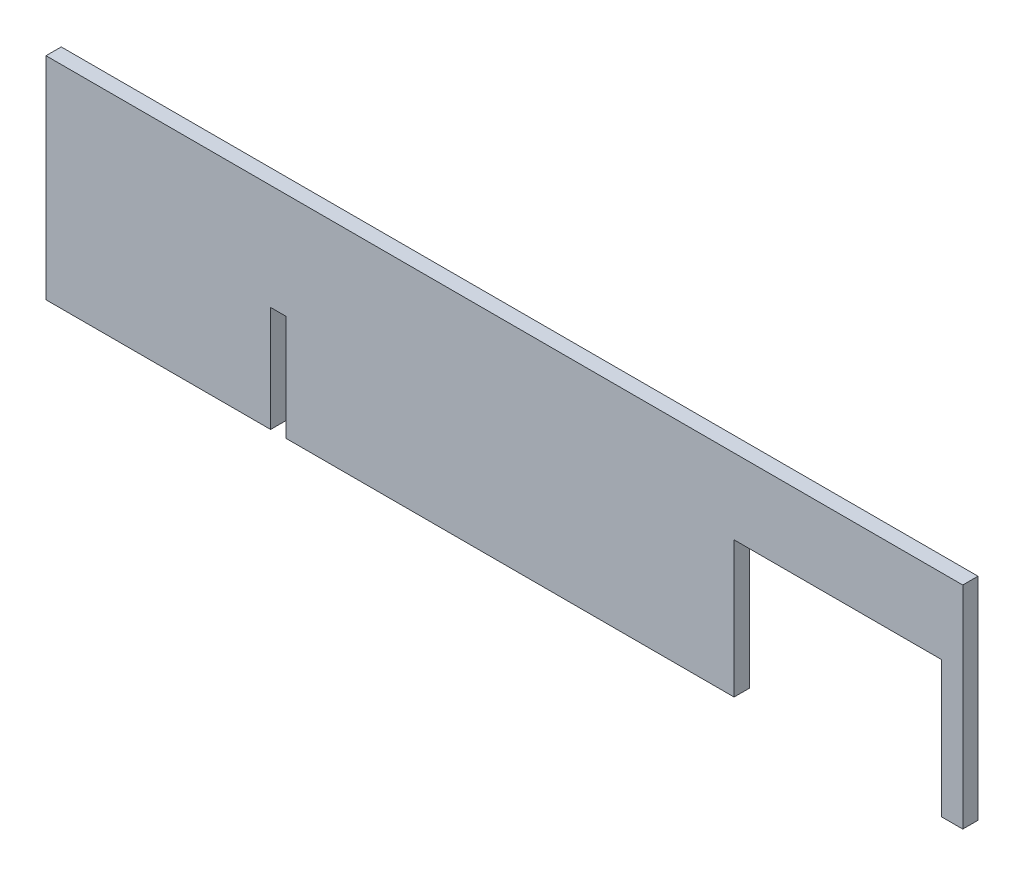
from build123d import *

# Parameters (mm, degrees)
SKETCH1_W          = 229.108
SKETCH1_H          = 52.832
EXTRUDE1_DEPTH     = 3.81
SKETCH2_W          = 3.81
SKETCH2_H          = 34.473303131
SKETCH2_W_2        = 51.816
CUT_EXTRUDE1_DEPTH = 236.151466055


with BuildPart() as part:
    # Sketch1 → Extrude1 (new body)
    with BuildSketch(Plane.XY):
        with Locations((-114.554, 26.416)):
            Rectangle(SKETCH1_W, SKETCH1_H)
    extrude(amount=EXTRUDE1_DEPTH)

    # Sketch2 → Cut-Extrude1 (cut, through all)
    with BuildSketch(Plane.XY):
        with Locations((-171.069, 9.179348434)):
            Rectangle(SKETCH2_W, SKETCH2_H)
        with Locations((-31.242, 16.799348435)):
            Rectangle(SKETCH2_W_2, SKETCH2_H)
    extrude(amount=CUT_EXTRUDE1_DEPTH, mode=Mode.SUBTRACT)


solid = part.part
